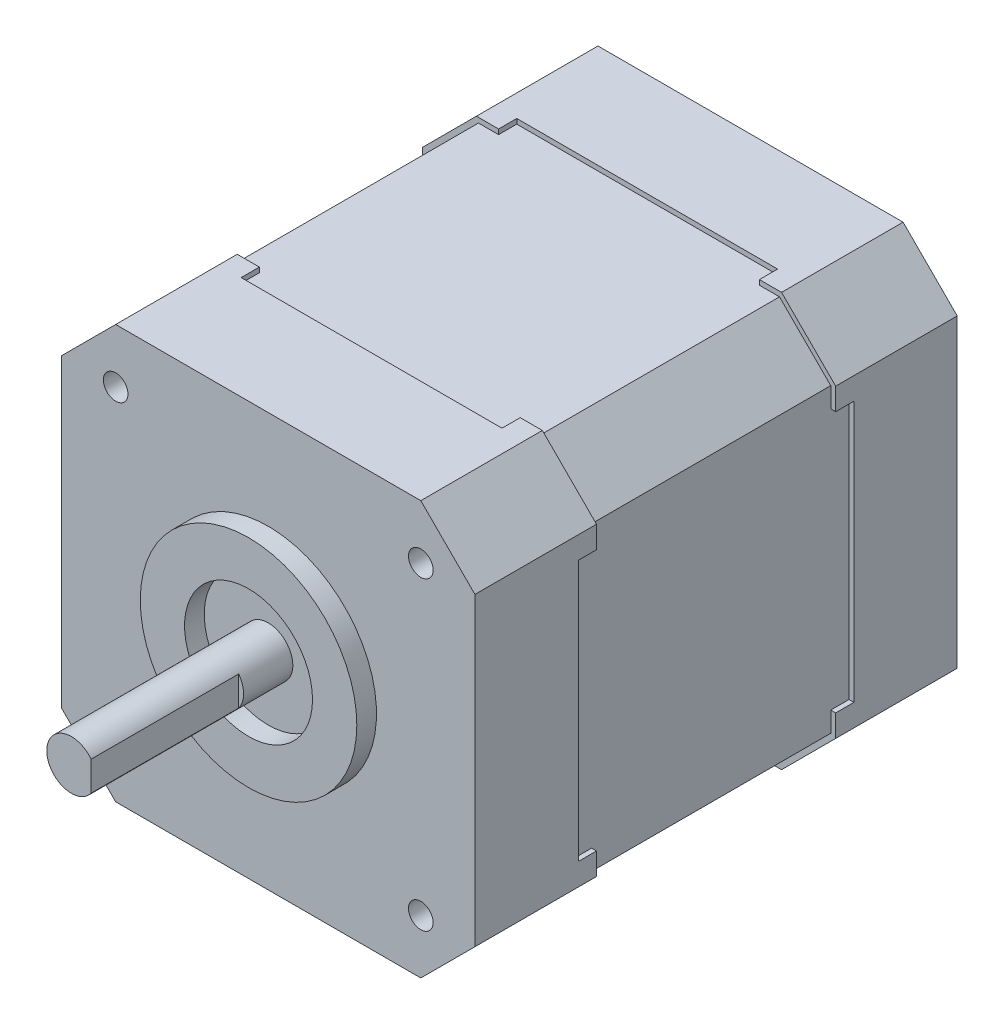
from build123d import *

# Parameters (mm, degrees)
EXTRUDE_1_DEPTH        = 49
SKETCH_2_R             = 11
SKETCH_2_R_2           = 6.5
EXTRUDE_2_DEPTH        = 2
SKETCH_3_R             = 2.5
EXTRUDE_3_DEPTH        = 20
CUT_EXTRUDE_START      = -15
CUT_EXTRUDE_1_DEPTH    = 15
SKETCH_6_W             = 24.3
SKETCH_6_H             = 0.5
CUT_EXTRUDE_START_2    = -0.5
SKETCH_7_W             = 26.5
SKETCH_7_H             = 28
CUT_EXTRUDE_2_DEPTH    = 0.5
SKETCH_8_W             = 28
SKETCH_8_H             = 26.5
CUT_EXTRUDE_3_DEPTH    = 0.5
SKETCH_9_W             = 26.5
SKETCH_9_H             = 28
CUT_EXTRUDE_4_DEPTH    = 0.5
SKETCH_10_W            = 28
SKETCH_10_H            = 26.5
CUT_EXTRUDE_5_DEPTH    = 0.5
HOLE_WIZARD_M3_1_D     = 2.5
HOLE_WIZARD_M3_1_DEPTH = 4.5
HOLE_WIZARD_M3_1_TIP   = 0.751075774


with BuildPart() as part:
    # Sketch 1 → Extrude 1 (new body)
    with BuildSketch(Plane.XY):
        Polygon((-21, 15.5), (-15.5, 21), (15.5, 21), (21, 15.5), (21, -15.5), (15.5, -21), (-15.5, -21), (-21, -15.5), align=None)
    extrude(amount=-EXTRUDE_1_DEPTH)

    # Sketch 2 → Extrude 2 (add)
    with BuildSketch(Plane.XY):
        with Locations(Location((0, 0, 0), (0, 0, 180))):
            Circle(SKETCH_2_R)
        Circle(SKETCH_2_R_2, mode=Mode.SUBTRACT)
    extrude(amount=EXTRUDE_2_DEPTH)

    # Sketch 3 → Extrude 3 (add)
    with BuildSketch(Plane.XY):
        with Locations(Location((0, 0, 0), (0, 0, 180))):
            Circle(SKETCH_3_R)
    extrude(amount=EXTRUDE_3_DEPTH)

    # Sketch 4 → Cut-Extrude 1 (cut)
    with BuildSketch(Plane.XY.offset(20).offset(CUT_EXTRUDE_START)):
        with BuildLine():
            Line((2, 1.5), (2, -1.5))
            ThreePointArc((2, -1.5), (2.5, 0), (2, 1.5))
        make_face()
    extrude(amount=CUT_EXTRUDE_1_DEPTH, mode=Mode.SUBTRACT)

    # Sweep 1: sweep along a path in Sketch 5
    with BuildLine(Plane.XY.offset(-12.35)) as sweep_1_path:
        Line((15.5, 21), (-15.5, 21))
        Line((-15.5, 21), (-21, 15.5))
        Line((-21, 15.5), (-21, -15.5))
        Line((-21, -15.5), (-15.5, -21))
        Line((-15.5, -21), (15.5, -21))
        Line((15.5, -21), (21, -15.5))
        Line((21, -15.5), (21, 15.5))
        Line((21, 15.5), (15.5, 21))
    # Sketch 6 → Sweep 1 (sweep, cut)
    with BuildSketch(Plane(origin=(0, 0, 0), x_dir=(0, 0, -1), z_dir=(1, 0, 0))):
        with Locations((24.5, 20.75)):
            Rectangle(SKETCH_6_W, SKETCH_6_H)
    sweep(path=sweep_1_path.line, transition=Transition.RIGHT, mode=Mode.SUBTRACT)

    # Sketch 7 → Cut-Extrude 2 (cut)
    with BuildSketch(Plane(origin=(0, 21, 0), x_dir=(1, 0, 0), z_dir=(0, 1, 0)).offset(CUT_EXTRUDE_START_2)):
        with Locations((0, 24.5)):
            Rectangle(SKETCH_7_W, SKETCH_7_H)
    extrude(amount=CUT_EXTRUDE_2_DEPTH, mode=Mode.SUBTRACT)

    # Sketch 8 → Cut-Extrude 3 (cut)
    with BuildSketch(Plane(origin=(21, 0, 0), x_dir=(0, 0, -1), z_dir=(1, 0, 0))):
        with Locations((24.5, 0)):
            Rectangle(SKETCH_8_W, SKETCH_8_H)
    extrude(amount=-CUT_EXTRUDE_3_DEPTH, mode=Mode.SUBTRACT)

    # Sketch 9 → Cut-Extrude 4 (cut)
    with BuildSketch(Plane.XZ.offset(21)):
        with Locations((0, -24.5)):
            Rectangle(SKETCH_9_W, SKETCH_9_H)
    extrude(amount=-CUT_EXTRUDE_4_DEPTH, mode=Mode.SUBTRACT)

    # Sketch 10 → Cut-Extrude 5 (cut)
    with BuildSketch(Plane.ZY.offset(21)):
        with Locations((-24.5, 0)):
            Rectangle(SKETCH_10_W, SKETCH_10_H)
    extrude(amount=-CUT_EXTRUDE_5_DEPTH, mode=Mode.SUBTRACT)

    # Hole Wizard M3 _1
    with Locations(Plane.XY):
        with Locations((-15.5, 15.5), (15.5, 15.5), (15.5, -15.5), (-15.5, -15.5)):
            Hole(HOLE_WIZARD_M3_1_D / 2, depth=HOLE_WIZARD_M3_1_DEPTH)
            with Locations((0, 0, -(HOLE_WIZARD_M3_1_DEPTH + HOLE_WIZARD_M3_1_TIP / 2))):  # 118° drill point
                Cone(0, HOLE_WIZARD_M3_1_D / 2, HOLE_WIZARD_M3_1_TIP, mode=Mode.SUBTRACT)


solid = part.part
